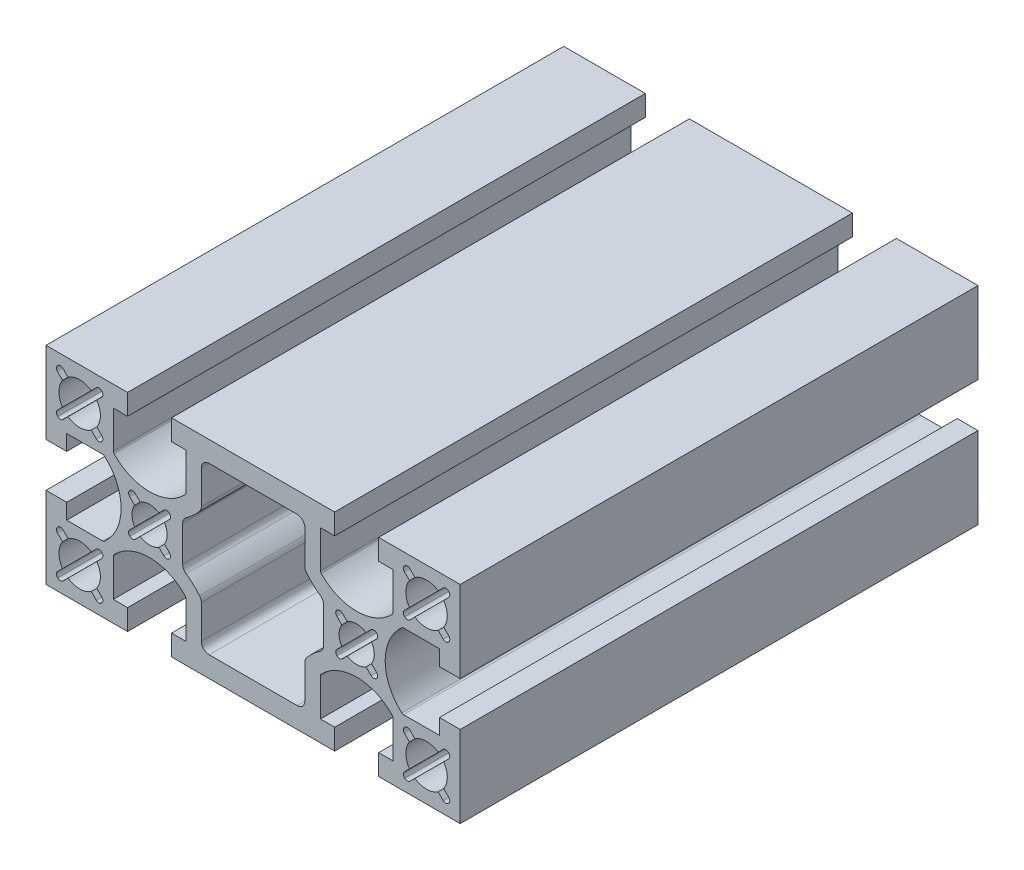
from build123d import *

# Parameters (mm, degrees)
SKETCH_1_W                     = 80
SKETCH_1_H                     = 40
EXTRUDE_1_DEPTH                = 50
SKETCH_2_R                     = 3.4
CUT_EXTRUDE_1_DEPTH            = 110.544511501
SKETCH_3_R                     = 4
CUT_EXTRUDE_2_DEPTH            = 110.544511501
CUT_EXTRUDE_3_DEPTH            = 110.544511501
PATTERN_LINEAR_1_COUNT         = 2
PATTERN_LINEAR_1_PITCH         = 40
PATTERN_LINEAR_1_COPY_1_DEPTH  = 110.544511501
CUT_EXTRUDE_4_DEPTH            = 110.544511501
CUT_EXTRUDE_5_DEPTH            = 110.544511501
CUT_EXTRUDE_6_DEPTH            = 110.544511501
FILLET_1_R                     = 0.7
PATTERN_LINEAR_2_COUNT         = 2
PATTERN_LINEAR_2_PITCH         = 67
PATTERN_LINEAR_2_COUNT_DIR2    = 2
PATTERN_LINEAR_2_PITCH_DIR2    = 27
FILLET_1_OF_PATTERN_LINEAR_2_R = 0.7
CUT_EXTRUDE_7_DEPTH            = 110.544511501
PATTERN_LINEAR_3_COUNT         = 2
PATTERN_LINEAR_3_PITCH         = 40


with BuildPart() as part:
    # Sketch 1 → Extrude 1 (new, symmetric)
    with BuildSketch(Plane.XY):
        Rectangle(SKETCH_1_W, SKETCH_1_H)
    extrude(amount=EXTRUDE_1_DEPTH, both=True)

    # Sketch 2 → Cut-Extrude 1 (cut, through all)
    with BuildSketch(Plane.XY.offset(50)):
        with Locations((-20, 0)):
            Circle(SKETCH_2_R)
        with Locations((20, 0)):
            Circle(SKETCH_2_R)
    extrude(amount=-CUT_EXTRUDE_1_DEPTH, mode=Mode.SUBTRACT)

    # Sketch 3 → Cut-Extrude 2 (cut, through all)
    with BuildSketch(Plane.XY.offset(50)):
        with Locations((-33.5, 13.5)):
            Circle(SKETCH_3_R)
        with Locations((33.5, 13.5)):
            Circle(SKETCH_3_R)
        with Locations((33.5, -13.5)):
            Circle(SKETCH_3_R)
        with Locations((-33.5, -13.5)):
            Circle(SKETCH_3_R)
    extrude(amount=-CUT_EXTRUDE_2_DEPTH, mode=Mode.SUBTRACT)

    # Sketch 4 → Cut-Extrude 3 (cut, through all)
    with BuildSketch(Plane.XY.offset(50)):
        with BuildLine():
            Line((15.75, 20), (24.25, 20))
            Line((24.25, 20), (24.25, 16))
            Line((24.25, 16), (27, 16))
            Line((27, 16), (27, 8.775050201))
            ThreePointArc((27, 8.775050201), (26.963980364, 8.588711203), (26.861111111, 8.429219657))
            ThreePointArc((26.861111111, 8.429219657), (20, 5.5), (13.138888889, 8.429219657))
            ThreePointArc((13.138888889, 8.429219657), (13.036019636, 8.588711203), (13, 8.775050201))
            Line((13, 8.775050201), (13, 16))
            Line((13, 16), (15.75, 16))
            Line((15.75, 16), (15.75, 20))
        make_face()
    cut_extrude_3 = extrude(amount=-CUT_EXTRUDE_3_DEPTH, mode=Mode.SUBTRACT)

    # Mirror 1: Cut-Extrude 3 across plane
    add(cut_extrude_3.mirror(Plane.ZX), mode=Mode.SUBTRACT)

    # Pattern Linear 1: Cut-Extrude 3 ×2
    with Locations(*[(-i * PATTERN_LINEAR_1_PITCH, 0, 0) for i in range(1, PATTERN_LINEAR_1_COUNT)]):
        add(cut_extrude_3, mode=Mode.SUBTRACT)

    # Pattern Linear 1 copy 1 sketch → Pattern Linear 1 copy 1 (cut, through all)
    with BuildSketch(Plane(origin=(-40, 0, 50), x_dir=(1, 0, 0), z_dir=(0, 0, 1))):
        with BuildLine():
            Line((15.75, -20), (24.25, -20))
            Line((24.25, -20), (24.25, -16))
            Line((24.25, -16), (27, -16))
            Line((27, -16), (27, -8.775050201))
            ThreePointArc((27, -8.775050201), (26.963980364, -8.588711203), (26.861111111, -8.429219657))
            ThreePointArc((26.861111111, -8.429219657), (20, -5.5), (13.138888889, -8.429219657))
            ThreePointArc((13.138888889, -8.429219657), (13.036019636, -8.588711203), (13, -8.775050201))
            Line((13, -8.775050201), (13, -16))
            Line((13, -16), (15.75, -16))
            Line((15.75, -16), (15.75, -20))
        make_face()
    extrude(amount=-PATTERN_LINEAR_1_COPY_1_DEPTH, mode=Mode.SUBTRACT)

    # Sketch 5 → Cut-Extrude 4 (cut, through all)
    with BuildSketch(Plane.XY.offset(50)):
        with BuildLine():
            Line((-40, -4.25), (-40, 4.25))
            Line((-40, 4.25), (-36, 4.25))
            Line((-36, 4.25), (-36, 7.25))
            Line((-36, 7.25), (-29.04705955, 7.25))
            ThreePointArc((-29.04705955, 7.25), (-28.870282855, 7.217707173), (-28.716340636, 7.125))
            ThreePointArc((-28.716340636, 7.125), (-25.5, 0), (-28.716340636, -7.125))
            ThreePointArc((-28.716340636, -7.125), (-28.870282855, -7.217707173), (-29.04705955, -7.25))
            Line((-29.04705955, -7.25), (-36, -7.25))
            Line((-36, -7.25), (-36, -4.25))
            Line((-36, -4.25), (-40, -4.25))
        make_face()
    cut_extrude_4 = extrude(amount=-CUT_EXTRUDE_4_DEPTH, mode=Mode.SUBTRACT)

    # Mirror 2: Cut-Extrude 4 across plane
    add(cut_extrude_4.mirror(Plane(origin=(0, 0, 0), x_dir=(0, 0, 1), z_dir=(1, 0, 0))), mode=Mode.SUBTRACT)

    # Sketch 7 → Cut-Extrude 5 (cut, through all)
    with BuildSketch(Plane.XY.offset(50)):
        with BuildLine():
            Line((-8.5, 16), (8.5, 16))
            ThreePointArc((8.5, 16), (9.560660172, 15.560660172), (10, 14.5))
            Line((10, 14.5), (10, 8.017879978))
            ThreePointArc((10, 8.017879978), (10.087796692, 7.512230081), (10.340909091, 7.065772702))
            ThreePointArc((10.340909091, 7.065772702), (11.558972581, 5.780506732), (12.946428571, 4.680255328))
            ThreePointArc((12.946428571, 4.680255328), (13.426582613, 4.142013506), (13.6, 3.441885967))
            Line((13.6, 3.441885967), (13.6, -3.441885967))
            ThreePointArc((13.6, -3.441885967), (13.426582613, -4.142013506), (12.946428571, -4.680255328))
            ThreePointArc((12.946428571, -4.680255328), (11.558972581, -5.780506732), (10.340909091, -7.065772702))
            ThreePointArc((10.340909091, -7.065772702), (10.087796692, -7.512230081), (10, -8.017879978))
            Line((10, -8.017879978), (10, -14.5))
            ThreePointArc((10, -14.5), (9.560660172, -15.560660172), (8.5, -16))
            Line((8.5, -16), (-8.5, -16))
            ThreePointArc((-8.5, -16), (-9.560660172, -15.560660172), (-10, -14.5))
            Line((-10, -14.5), (-10, -8.017879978))
            ThreePointArc((-10, -8.017879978), (-10.087796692, -7.512230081), (-10.340909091, -7.065772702))
            ThreePointArc((-10.340909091, -7.065772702), (-11.558972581, -5.780506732), (-12.946428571, -4.680255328))
            ThreePointArc((-12.946428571, -4.680255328), (-13.426582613, -4.142013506), (-13.6, -3.441885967))
            Line((-13.6, -3.441885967), (-13.6, 3.441885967))
            ThreePointArc((-13.6, 3.441885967), (-13.426582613, 4.142013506), (-12.946428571, 4.680255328))
            ThreePointArc((-12.946428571, 4.680255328), (-11.558972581, 5.780506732), (-10.340909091, 7.065772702))
            ThreePointArc((-10.340909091, 7.065772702), (-10.087796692, 7.512230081), (-10, 8.017879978))
            Line((-10, 8.017879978), (-10, 14.5))
            ThreePointArc((-10, 14.5), (-9.560660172, 15.560660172), (-8.5, 16))
        make_face()
    extrude(amount=-CUT_EXTRUDE_5_DEPTH, mode=Mode.SUBTRACT)

    # Sketch 8 → Cut-Extrude 6 (cut, through all)
    with BuildSketch(Plane.XY.offset(50)):
        with BuildLine():
            Line((-29.820965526, 18.239694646), (-31.25206624, 16.808593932))
            ThreePointArc((-31.25206624, 16.808593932), (-30.671572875, 16.328427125), (-30.191406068, 15.74793376))
            Line((-30.191406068, 15.74793376), (-28.760305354, 17.179034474))
            ThreePointArc((-28.760305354, 17.179034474), (-29.257359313, 17.742640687), (-29.820965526, 18.239694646))
        make_face()
        with BuildLine():
            ThreePointArc((-36.808593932, 15.74793376), (-36.328427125, 16.328427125), (-35.74793376, 16.808593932))
            Line((-35.74793376, 16.808593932), (-37.179034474, 18.239694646))
            ThreePointArc((-37.179034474, 18.239694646), (-37.742640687, 17.742640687), (-38.239694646, 17.179034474))
            Line((-38.239694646, 17.179034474), (-36.808593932, 15.74793376))
        make_face()
        with BuildLine():
            ThreePointArc((-35.74793376, 10.191406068), (-36.328427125, 10.671572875), (-36.808593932, 11.25206624))
            Line((-36.808593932, 11.25206624), (-38.239694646, 9.820965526))
            ThreePointArc((-38.239694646, 9.820965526), (-37.742640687, 9.257359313), (-37.179034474, 8.760305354))
            Line((-37.179034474, 8.760305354), (-35.74793376, 10.191406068))
        make_face()
        with BuildLine():
            Line((-28.760305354, 9.820965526), (-30.191406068, 11.25206624))
            ThreePointArc((-30.191406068, 11.25206624), (-30.671572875, 10.671572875), (-31.25206624, 10.191406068))
            Line((-31.25206624, 10.191406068), (-29.820965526, 8.760305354))
            ThreePointArc((-29.820965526, 8.760305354), (-29.257359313, 9.257359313), (-28.760305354, 9.820965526))
        make_face()
    cut_extrude_6 = extrude(amount=-CUT_EXTRUDE_6_DEPTH, mode=Mode.SUBTRACT)

    # Fillet 1
    fillet_1_edges = [part.edges().sort_by_distance(p)[0] for p in [
        (-37.179034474, 8.760305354, 0),
        (-38.239694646, 9.820965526, 0),
        (-38.239694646, 17.179034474, 0),
        (-37.179034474, 18.239694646, 0),
        (-29.820965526, 18.239694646, 0),
        (-28.760305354, 17.179034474, 0),
        (-28.760305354, 9.820965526, 0),
        (-29.820965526, 8.760305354, 0),
    ]]
    fillet(fillet_1_edges, radius=FILLET_1_R)

    # Pattern Linear 2: Cut-Extrude 6 2 × 2
    with Locations(*[(i * PATTERN_LINEAR_2_PITCH, -j * PATTERN_LINEAR_2_PITCH_DIR2, 0) for i in range(PATTERN_LINEAR_2_COUNT) for j in range(PATTERN_LINEAR_2_COUNT_DIR2) if (i, j) != (0, 0)]):
        add(cut_extrude_6, mode=Mode.SUBTRACT)

    # Fillet 1 of Pattern Linear 2
    fillet_1_of_pattern_linear_2_edges = [part.edges().sort_by_distance(p)[0] for p in [
        (-37.179034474, -18.239694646, 0),
        (-38.239694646, -17.179034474, 0),
        (-38.239694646, -9.820965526, 0),
        (-37.179034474, -8.760305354, 0),
        (-29.820965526, -8.760305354, 0),
        (-28.760305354, -9.820965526, 0),
        (-28.760305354, -17.179034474, 0),
        (-29.820965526, -18.239694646, 0),
        (29.820965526, 8.760305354, 0),
        (28.760305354, 9.820965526, 0),
        (28.760305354, 17.179034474, 0),
        (29.820965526, 18.239694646, 0),
        (37.179034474, 18.239694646, 0),
        (38.239694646, 17.179034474, 0),
        (38.239694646, 9.820965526, 0),
        (37.179034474, 8.760305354, 0),
        (29.820965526, -18.239694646, 0),
        (28.760305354, -17.179034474, 0),
        (28.760305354, -9.820965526, 0),
        (29.820965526, -8.760305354, 0),
        (37.179034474, -8.760305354, 0),
        (38.239694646, -9.820965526, 0),
        (38.239694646, -17.179034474, 0),
        (37.179034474, -18.239694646, 0),
    ]]
    fillet(fillet_1_of_pattern_linear_2_edges, radius=FILLET_1_OF_PATTERN_LINEAR_2_R)

    # Sketch 9 → Cut-Extrude 7 (cut, through all)
    with BuildSketch(Plane.XY.offset(50)):
        with BuildLine():
            Line((-18.185388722, 2.87527145), (-17.235220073, 3.825440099))
            ThreePointArc((-17.235220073, 3.825440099), (-16.712755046, 4.042180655), (-16.189826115, 3.826561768))
            ThreePointArc((-16.189826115, 3.826561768), (-16.181623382, 3.818376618), (-16.173438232, 3.810173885))
            ThreePointArc((-16.173438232, 3.810173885), (-15.957819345, 3.287244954), (-16.174559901, 2.764779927))
            Line((-16.174559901, 2.764779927), (-17.12472855, 1.814611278))
            ThreePointArc((-17.12472855, 1.814611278), (-16.6, 0), (-17.12472855, -1.814611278))
            Line((-17.12472855, -1.814611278), (-16.174559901, -2.764779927))
            ThreePointArc((-16.174559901, -2.764779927), (-15.957819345, -3.287244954), (-16.173438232, -3.810173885))
            ThreePointArc((-16.173438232, -3.810173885), (-16.181623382, -3.818376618), (-16.189826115, -3.826561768))
            ThreePointArc((-16.189826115, -3.826561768), (-16.712755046, -4.042180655), (-17.235220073, -3.825440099))
            Line((-17.235220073, -3.825440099), (-18.185388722, -2.87527145))
            ThreePointArc((-18.185388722, -2.87527145), (-20, -3.4), (-21.814611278, -2.87527145))
            Line((-21.814611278, -2.87527145), (-22.764779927, -3.825440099))
            ThreePointArc((-22.764779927, -3.825440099), (-23.287244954, -4.042180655), (-23.810173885, -3.826561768))
            ThreePointArc((-23.810173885, -3.826561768), (-23.818376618, -3.818376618), (-23.826561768, -3.810173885))
            ThreePointArc((-23.826561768, -3.810173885), (-24.042180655, -3.287244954), (-23.825440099, -2.764779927))
            Line((-23.825440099, -2.764779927), (-22.87527145, -1.814611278))
            ThreePointArc((-22.87527145, -1.814611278), (-23.4, 0), (-22.87527145, 1.814611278))
            Line((-22.87527145, 1.814611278), (-23.825440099, 2.764779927))
            ThreePointArc((-23.825440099, 2.764779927), (-24.042180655, 3.287244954), (-23.826561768, 3.810173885))
            ThreePointArc((-23.826561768, 3.810173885), (-23.818376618, 3.818376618), (-23.810173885, 3.826561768))
            ThreePointArc((-23.810173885, 3.826561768), (-23.287244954, 4.042180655), (-22.764779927, 3.825440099))
            Line((-22.764779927, 3.825440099), (-21.814611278, 2.87527145))
            ThreePointArc((-21.814611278, 2.87527145), (-20, 3.4), (-18.185388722, 2.87527145))
        make_face()
    cut_extrude_7 = extrude(amount=-CUT_EXTRUDE_7_DEPTH, mode=Mode.SUBTRACT)

    # Pattern Linear 3: Cut-Extrude 7 ×2
    with Locations(*[(i * PATTERN_LINEAR_3_PITCH, 0, 0) for i in range(1, PATTERN_LINEAR_3_COUNT)]):
        add(cut_extrude_7, mode=Mode.SUBTRACT)


solid = part.part
